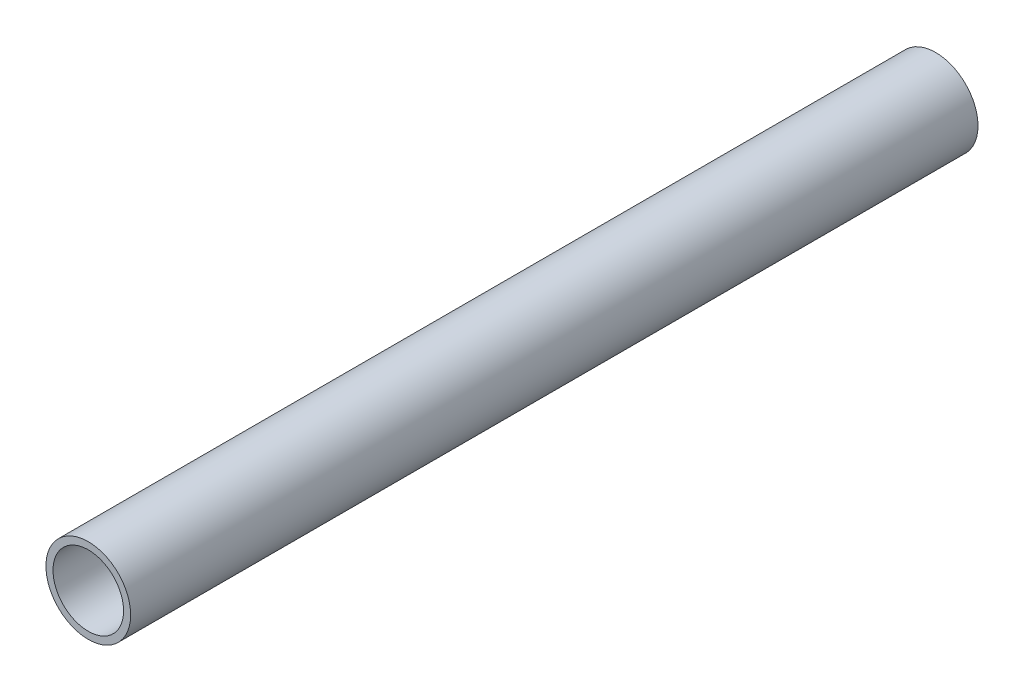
from build123d import *

# Parameters (mm, degrees)
ESQUISSE1_R      = 30
ESQUISSE1_R_2    = 25
EXTRUSION1_DEPTH = 600


with BuildPart() as part:
    # Esquisse1 → Extrusion1 (new body)
    with BuildSketch(Plane.XY):
        Circle(ESQUISSE1_R)
        Circle(ESQUISSE1_R_2, mode=Mode.SUBTRACT)
    extrude(amount=EXTRUSION1_DEPTH)


solid = part.part
